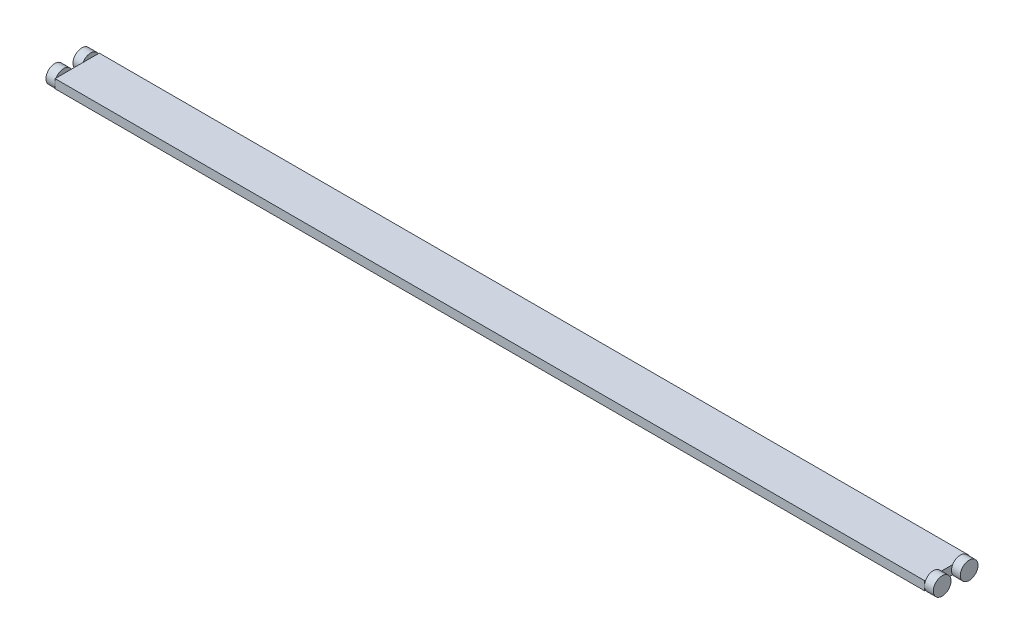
from build123d import *

# Parameters (mm, degrees)
SKIZZE1_W                       = 984
SKIZZE1_H                       = 50
AUFSATZ_LINEAR_AUSTRAGEN1_DEPTH = 5
SKIZZE2_R                       = 10
AUFSATZ_LINEAR_AUSTRAGEN2_DEPTH = 10


with BuildPart() as part:
    # Skizze1 → Aufsatz-Linear austragen1 (new, symmetric)
    with BuildSketch(Plane(origin=(0, 0, 0), x_dir=(1, 0, 0), z_dir=(0, 1, 0))):
        Rectangle(SKIZZE1_W, SKIZZE1_H)
    extrude(amount=AUFSATZ_LINEAR_AUSTRAGEN1_DEPTH, both=True)

    # Skizze2 → Aufsatz-Linear austragen2 (add)
    with BuildSketch(Plane(origin=(492, 0, 0), x_dir=(0, 0, -1), z_dir=(1, 0, 0))):
        with Locations(Location((15.282934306, 0, 0), (0, 0, 150))):
            Circle(SKIZZE2_R)
        with Locations(Location((-15.282934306, 0, 0), (0, 0, 166.338142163))):
            Circle(SKIZZE2_R)
    aufsatz_linear_austragen2 = extrude(amount=AUFSATZ_LINEAR_AUSTRAGEN2_DEPTH)

    # Spiegeln1: Aufsatz-Linear austragen2 across plane
    add(aufsatz_linear_austragen2.mirror(Plane(origin=(0, 0, 0), x_dir=(0, 0, 1), z_dir=(1, 0, 0))))


solid = part.part
